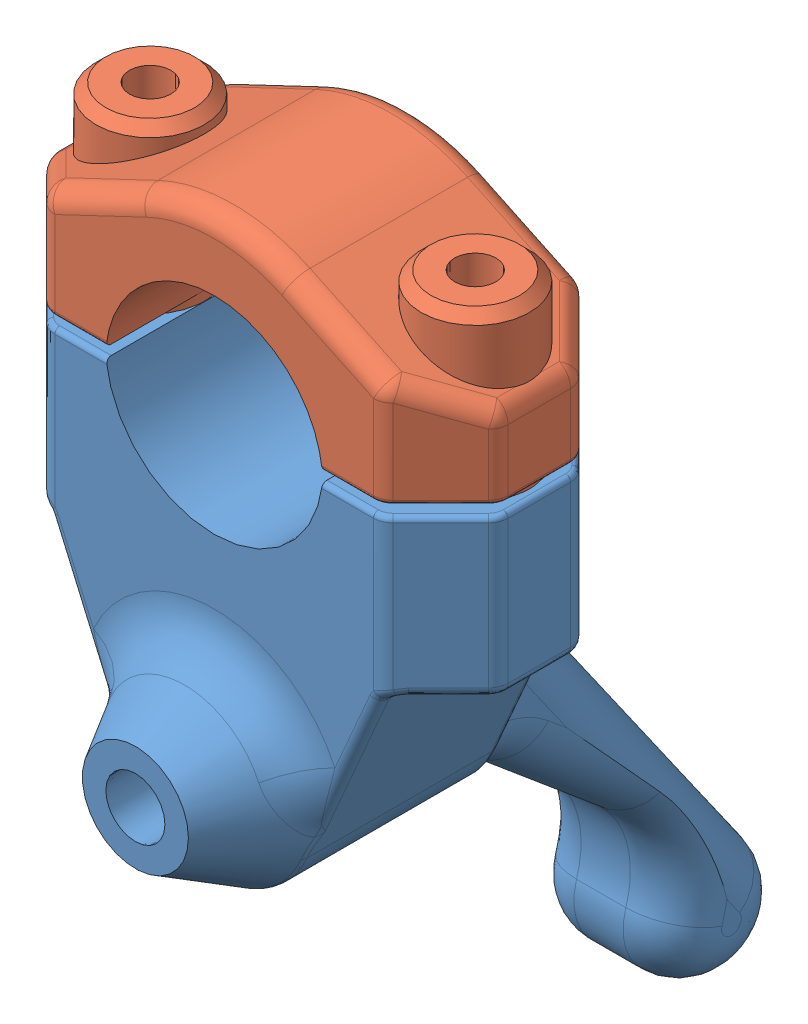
SolidWorks assembly Levier de commande.SLDASM, configuration Défaut (file format 7000). Lengths in mm.
Overall size (46 87 59).
2 component instances, 2 part files, 3 mates.
Components (placement in the parent):
- Corps de levier-1: Corps de levier.SLDPRT [Défaut] at origin size (46 69 59)
- Bride de levier-1: Bride de levier.SLDPRT [Défaut] at (0 -1 0) x (-1 0 0) z (0 0 1) size (46 18 20)
Mates (geometry in assembly coordinates):
- Coïncidente1: coincident: plane of Corps de levier-1 through (0 0 10) normal (0 0 1); plane of Bride de levier-1 through (0 9.7327 10) normal (0 0 1)
- Coïncidente2: coincident: plane of Corps de levier-1 through (23 -17 10) normal (1 0 0); plane of Bride de levier-1 through (23 10.7327 10) normal (1 0 0)
- Coïncidente3: coincident anti-aligned: plane of Corps de levier-1 through (23 -1 10) normal (0 1 0); plane of Bride de levier-1 through (16.5 -1 0) normal (0 -1 0)
